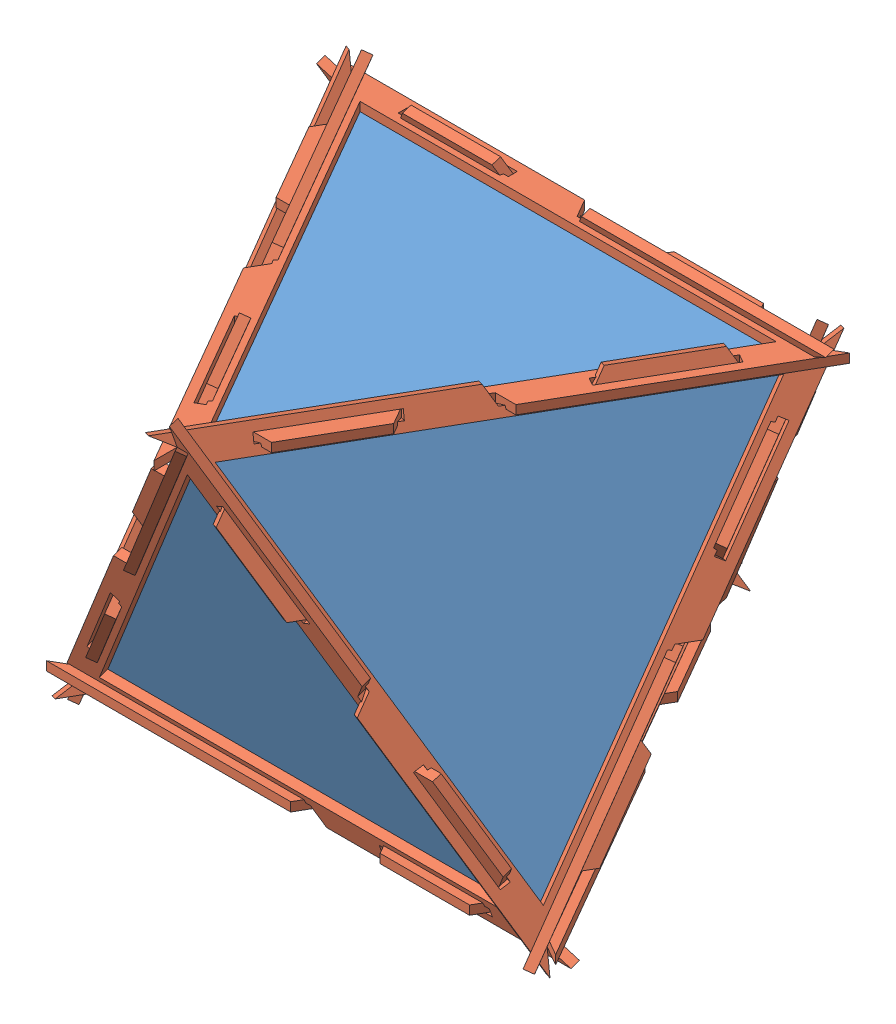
SolidWorks assembly Ensamblaje1.sldasm, configuration Predeterminado (file format 7000). Lengths in mm.
Overall size (838.99 917.44 895.24).
9 component instances, 2 part files, 16 mates.
Components (placement in the parent):
- octaedro-1: octaedro.SLDPRT [Predeterminado] at (-84.9873 -141.0603 577.3503) size (500 408.25 577.35)
- Pieza5-1: Pieza5.SLDPRT [Predeterminado] at (81.6794 -4.9775 481.1252) x (0 -0.816497 0.57735) z (0.57735 0.471405 0.666667) size (569.28 10 493.01)
- Pieza5-2: Pieza5.SLDPRT [Predeterminado] at (-251.654 -4.9775 481.1252) x (0 0.816497 -0.57735) z (-0.57735 0.471405 0.666667) size (569.28 10 493.01)
- Pieza5-3: Pieza5.SLDPRT [Predeterminado] at (-84.9873 -141.0603 577.3503) x (0.5 0 -0.866025) z (-0.866025 0 -0.5) size (569.28 10 493.01)
- Pieza5-4: Pieza5.SLDPRT [Predeterminado] at (-84.9873 131.1052 384.9002) x (-0.5 0.816497 0.288675) z (-0.866025 -0.471405 -0.166667) size (569.28 10 493.01)
- Pieza5-5: Pieza5.SLDPRT [Predeterminado] at (81.6794 131.1052 673.5753) x (0.5 -0.816497 -0.288675) z (-0.288675 -0.471405 0.833333) size (569.28 10 493.01)
- Pieza5-6: Pieza5.SLDPRT [Predeterminado] at (-84.9873 267.188 577.3503) x (0.5 0 0.866025) z (-0.866025 0 0.5) size (569.28 10 493.01)
- Pieza5-7: Pieza5.SLDPRT [Predeterminado] at (-84.9873 -4.9775 769.8004) x (-0.5 -0.816497 -0.288675) z (-0.866025 0.471405 0.166667) size (569.28 10 493.01)
- Pieza5-8: Pieza5.SLDPRT [Predeterminado] at (-251.654 131.1052 673.5753) x (0.5 0.816497 0.288675) z (0.288675 -0.471405 0.833333) size (569.28 10 493.01)
Mates (geometry in assembly coordinates):
- Coincidente1: coincident aligned: line of octaedro-1 through (-334.9873 267.188 433.0127) axis (0.5 0 0.866025); line of Pieza5-6 through (-334.9873 267.188 433.0127) axis (0.5 0 0.866025)
- Coincidente2: coincident aligned: line of octaedro-1 through (-84.9873 267.188 866.0254) axis (0.5 0 -0.866025); line of Pieza5-6 through (1.5597 267.188 716.1216) axis (0.5 0 -0.866025)
- Coincidente3: coincident aligned: line of octaedro-1 through (-84.9873 267.188 866.0254) axis (-0.5 -0.816497 -0.288675); line of Pieza5-7 through (-171.5343 125.8573 816.0575) axis (-0.5 -0.816497 -0.288675)
- Coincidente5: coincident anti-aligned: line of octaedro-1 through (-84.9873 267.188 866.0254) axis (0.5 -0.816497 -0.288675); line of Pieza5-7 through (78.4657 0.2704 771.6558) axis (-0.5 0.816497 0.288675)
- Coincidente6: coincident anti-aligned: line of octaedro-1 through (-84.9873 267.188 866.0254) axis (-0.5 -0.816497 -0.288675); line of Pieza5-8 through (-248.4403 0.2704 771.6558) axis (0.5 0.816497 0.288675)
- Coincidente7: coincident anti-aligned: line of octaedro-1 through (-334.9873 267.188 433.0127) axis (0.5 0 0.866025); line of Pieza5-8 through (-171.5343 267.188 716.1216) axis (-0.5 0 -0.866025)
- Coincidente8: coincident aligned: line of octaedro-1 through (-84.9873 267.188 866.0254) axis (0.5 -0.816497 -0.288675); line of Pieza5-5 through (1.5597 125.8573 816.0575) axis (0.5 -0.816497 -0.288675)
- Coincidente9: coincident anti-aligned: line of octaedro-1 through (-84.9873 267.188 866.0254) axis (0.5 0 -0.866025); line of Pieza5-5 through (78.4657 267.188 582.9165) axis (-0.5 0 0.866025)
- Coincidente10: coincident anti-aligned: line of octaedro-1 through (165.0127 -141.0603 721.6878) axis (0 0.816497 -0.57735); line of Pieza5-1 through (165.0127 267.188 433.0127) axis (0 -0.816497 0.57735)
- Coincidente11: coincident anti-aligned: line of octaedro-1 through (165.0127 267.188 433.0127) axis (-0.5 -0.816497 -0.288675); line of Pieza5-1 through (1.5597 0.2704 338.6431) axis (0.5 0.816497 0.288675)
- Coincidente12: coincident: line of octaedro-1 through (165.0127 267.188 433.0127) axis (-1 0 0); line of Pieza5-4 through (-334.9873 267.188 433.0127) axis (1 0 0)
- Coincidente14: coincident aligned: line of octaedro-1 through (165.0127 267.188 433.0127) axis (-0.5 -0.816497 -0.288675); line of Pieza5-4 through (78.4657 125.8573 383.0448) axis (-0.5 -0.816497 -0.288675)
- Coincidente15: coincident: line of octaedro-1 through (-84.9873 -141.0603 288.6751) axis (-0.5 0.816497 0.288675); line of Pieza5-2 through (-248.4403 125.8573 383.0448) axis (0.5 -0.816497 -0.288675)
- Coincidente16: coincident aligned: line of octaedro-1 through (-334.9873 -141.0603 721.6878) axis (0 0.816497 -0.57735); line of Pieza5-2 through (-334.9873 0.2704 621.752) axis (0 0.816497 -0.57735)
- Coincidente17: coincident: line of octaedro-1 through (-334.9873 -141.0603 721.6878) axis (0.5 0 -0.866025); line of Pieza5-3 through (-334.9873 -141.0603 721.6878) axis (0.5 0 -0.866025)
- Coincidente18: coincident aligned: line of octaedro-1 through (165.0127 -141.0603 721.6878) axis (-1 0 0); line of Pieza5-3 through (-8.0813 -141.0603 721.6878) axis (-1 0 0)
